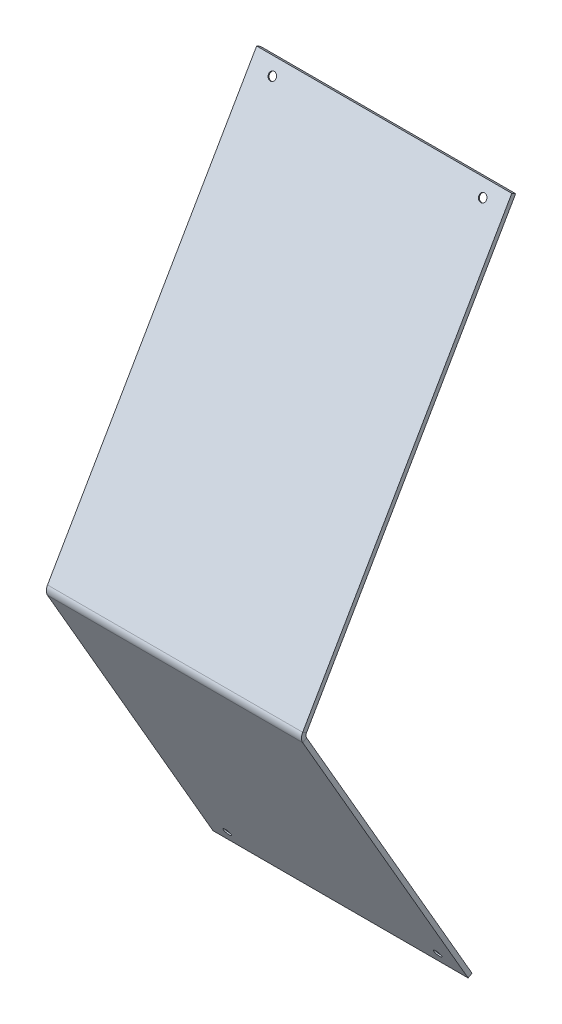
ISO-10303-21;
HEADER;
FILE_DESCRIPTION(('STEP AP214'),'2;1');
FILE_NAME('part.step','',(''),(''),'','','');
FILE_SCHEMA(('AUTOMOTIVE_DESIGN { 1 0 10303 214 1 1 1 1 }'));
ENDSEC;
DATA;
#1=APPLICATION_CONTEXT('core data for automotive mechanical design processes');
#2=APPLICATION_PROTOCOL_DEFINITION('international standard','automotive_design',2000,#1);
#3=PRODUCT_CONTEXT('',#1,'mechanical');
#4=PRODUCT('Part','Part','',(#3));
#5=PRODUCT_RELATED_PRODUCT_CATEGORY('part','',(#4));
#6=PRODUCT_DEFINITION_FORMATION('','',#4);
#7=PRODUCT_DEFINITION_CONTEXT('part definition',#1,'design');
#8=PRODUCT_DEFINITION('design','',#6,#7);
#9=PRODUCT_DEFINITION_SHAPE('','',#8);
#10=(LENGTH_UNIT() NAMED_UNIT(*) SI_UNIT(.MILLI.,.METRE.));
#11=(NAMED_UNIT(*) PLANE_ANGLE_UNIT() SI_UNIT($,.RADIAN.));
#12=(NAMED_UNIT(*) SI_UNIT($,.STERADIAN.) SOLID_ANGLE_UNIT());
#13=UNCERTAINTY_MEASURE_WITH_UNIT(LENGTH_MEASURE(1.E-05),#10,'distance_accuracy_value','');
#14=(GEOMETRIC_REPRESENTATION_CONTEXT(3) GLOBAL_UNCERTAINTY_ASSIGNED_CONTEXT((#13)) GLOBAL_UNIT_ASSIGNED_CONTEXT((#10,
#11,#12)) REPRESENTATION_CONTEXT('',''));
#15=CARTESIAN_POINT('',(0.,0.,0.));
#16=DIRECTION('',(0.,0.,1.));
#17=DIRECTION('',(1.,0.,0.));
#18=AXIS2_PLACEMENT_3D('',#15,#16,#17);
#19=CARTESIAN_POINT('',(57.,-1.00000000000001,-0.577350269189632));
#20=DIRECTION('',(1.,0.,0.));
#21=DIRECTION('',(0.,0.,-1.));
#22=AXIS2_PLACEMENT_3D('',#19,#20,#21);
#23=PLANE('',#22);
#24=DIRECTION('',(0.,-0.500000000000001,0.866025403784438));
#25=VECTOR('',#24,1.);
#26=CARTESIAN_POINT('',(57.,-1.00000000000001,-0.577350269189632));
#27=LINE('',#26,#25);
#28=CARTESIAN_POINT('',(57.,-1.00000000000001,-0.577350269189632));
#29=VERTEX_POINT('',#28);
#30=CARTESIAN_POINT('',(57.,-2.00000000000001,1.15470053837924));
#31=VERTEX_POINT('',#30);
#32=EDGE_CURVE('E11',#29,#31,#27,.T.);
#33=ORIENTED_EDGE('',*,*,#32,.F.);
#34=CARTESIAN_POINT('',(57.,0.,-2.3094010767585));
#35=DIRECTION('',(-1.,0.,0.));
#36=DIRECTION('',(0.,0.,1.));
#37=AXIS2_PLACEMENT_3D('',#34,#35,#36);
#38=CIRCLE('',#37,2.);
#39=CARTESIAN_POINT('',(57.,1.,-0.577350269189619));
#40=VERTEX_POINT('',#39);
#41=EDGE_CURVE('E133',#40,#29,#38,.F.);
#42=ORIENTED_EDGE('',*,*,#41,.F.);
#43=DIRECTION('',(0.,-0.500000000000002,-0.866025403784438));
#44=VECTOR('',#43,1.);
#45=CARTESIAN_POINT('',(57.,2.,1.15470053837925));
#46=LINE('',#45,#44);
#47=CARTESIAN_POINT('',(57.,2.,1.15470053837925));
#48=VERTEX_POINT('',#47);
#49=EDGE_CURVE('E43',#48,#40,#46,.T.);
#50=ORIENTED_EDGE('',*,*,#49,.F.);
#51=CARTESIAN_POINT('',(57.,0.,-2.3094010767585));
#52=DIRECTION('',(1.,0.,0.));
#53=DIRECTION('',(0.,0.,-1.));
#54=AXIS2_PLACEMENT_3D('',#51,#52,#53);
#55=CIRCLE('',#54,4.);
#56=EDGE_CURVE('E126',#48,#31,#55,.T.);
#57=ORIENTED_EDGE('',*,*,#56,.T.);
#58=EDGE_LOOP('',(#33,#42,#50,#57));
#59=FACE_BOUND('',#58,.T.);
#60=ADVANCED_FACE('F34',(#59),#23,.T.);
#61=CARTESIAN_POINT('',(57.,2.,1.15470053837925));
#62=DIRECTION('',(1.,0.,0.));
#63=DIRECTION('',(0.,0.,-1.));
#64=AXIS2_PLACEMENT_3D('',#61,#62,#63);
#65=PLANE('',#64);
#66=DIRECTION('',(0.,-0.866025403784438,-0.500000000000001));
#67=VECTOR('',#66,1.);
#68=CARTESIAN_POINT('',(57.,0.,0.));
#69=LINE('',#68,#67);
#70=CARTESIAN_POINT('',(57.,-129.037785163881,-74.5000000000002));
#71=VERTEX_POINT('',#70);
#72=EDGE_CURVE('E209',#29,#71,#69,.T.);
#73=ORIENTED_EDGE('',*,*,#72,.F.);
#74=ORIENTED_EDGE('',*,*,#32,.T.);
#75=DIRECTION('',(0.,-0.866025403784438,-0.500000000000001));
#76=VECTOR('',#75,1.);
#77=CARTESIAN_POINT('',(57.,-1.,1.73205080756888));
#78=LINE('',#77,#76);
#79=CARTESIAN_POINT('',(57.,-130.037785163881,-72.7679491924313));
#80=VERTEX_POINT('',#79);
#81=EDGE_CURVE('E92',#31,#80,#78,.T.);
#82=ORIENTED_EDGE('',*,*,#81,.T.);
#83=DIRECTION('',(0.,-0.499999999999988,0.866025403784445));
#84=VECTOR('',#83,1.);
#85=CARTESIAN_POINT('',(57.,-129.037785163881,-74.5000000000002));
#86=LINE('',#85,#84);
#87=EDGE_CURVE('E206',#71,#80,#86,.T.);
#88=ORIENTED_EDGE('',*,*,#87,.F.);
#89=EDGE_LOOP('',(#73,#74,#82,#88));
#90=FACE_BOUND('',#89,.T.);
#91=ADVANCED_FACE('F229',(#90),#65,.T.);
#92=CARTESIAN_POINT('',(-57.,1.,-0.577350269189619));
#93=DIRECTION('',(-1.,0.,0.));
#94=DIRECTION('',(0.,0.,1.));
#95=AXIS2_PLACEMENT_3D('',#92,#93,#94);
#96=PLANE('',#95);
#97=DIRECTION('',(0.,0.500000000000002,0.866025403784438));
#98=VECTOR('',#97,1.);
#99=CARTESIAN_POINT('',(-57.,1.,-0.577350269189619));
#100=LINE('',#99,#98);
#101=CARTESIAN_POINT('',(-57.,1.,-0.577350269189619));
#102=VERTEX_POINT('',#101);
#103=CARTESIAN_POINT('',(-57.,2.,1.15470053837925));
#104=VERTEX_POINT('',#103);
#105=EDGE_CURVE('E79',#102,#104,#100,.T.);
#106=ORIENTED_EDGE('',*,*,#105,.F.);
#107=CARTESIAN_POINT('',(-57.,0.,-2.3094010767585));
#108=DIRECTION('',(-1.,0.,0.));
#109=DIRECTION('',(0.,0.,1.));
#110=AXIS2_PLACEMENT_3D('',#107,#108,#109);
#111=CIRCLE('',#110,2.);
#112=CARTESIAN_POINT('',(-57.,-1.00000000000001,-0.577350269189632));
#113=VERTEX_POINT('',#112);
#114=EDGE_CURVE('E149',#102,#113,#111,.F.);
#115=ORIENTED_EDGE('',*,*,#114,.T.);
#116=DIRECTION('',(0.,0.500000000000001,-0.866025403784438));
#117=VECTOR('',#116,1.);
#118=CARTESIAN_POINT('',(-57.,-2.00000000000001,1.15470053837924));
#119=LINE('',#118,#117);
#120=CARTESIAN_POINT('',(-57.,-2.00000000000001,1.15470053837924));
#121=VERTEX_POINT('',#120);
#122=EDGE_CURVE('E86',#121,#113,#119,.T.);
#123=ORIENTED_EDGE('',*,*,#122,.F.);
#124=CARTESIAN_POINT('',(-57.,0.,-2.3094010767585));
#125=DIRECTION('',(1.,0.,0.));
#126=DIRECTION('',(0.,0.,-1.));
#127=AXIS2_PLACEMENT_3D('',#124,#125,#126);
#128=CIRCLE('',#127,4.);
#129=EDGE_CURVE('E156',#104,#121,#128,.T.);
#130=ORIENTED_EDGE('',*,*,#129,.F.);
#131=EDGE_LOOP('',(#106,#115,#123,#130));
#132=FACE_BOUND('',#131,.T.);
#133=ADVANCED_FACE('F227',(#132),#96,.T.);
#134=CARTESIAN_POINT('',(-57.,-2.00000000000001,1.15470053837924));
#135=DIRECTION('',(-1.,0.,0.));
#136=DIRECTION('',(0.,0.,1.));
#137=AXIS2_PLACEMENT_3D('',#134,#135,#136);
#138=PLANE('',#137);
#139=DIRECTION('',(0.,-0.866025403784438,0.500000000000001));
#140=VECTOR('',#139,1.);
#141=CARTESIAN_POINT('',(-57.,162.812775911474,-94.0000000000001));
#142=LINE('',#141,#140);
#143=CARTESIAN_POINT('',(-57.,162.812775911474,-94.0000000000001));
#144=VERTEX_POINT('',#143);
#145=EDGE_CURVE('E151',#144,#102,#142,.T.);
#146=ORIENTED_EDGE('',*,*,#145,.T.);
#147=ORIENTED_EDGE('',*,*,#105,.T.);
#148=DIRECTION('',(0.,-0.866025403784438,0.500000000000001));
#149=VECTOR('',#148,1.);
#150=CARTESIAN_POINT('',(-57.,163.812775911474,-92.2679491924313));
#151=LINE('',#150,#149);
#152=CARTESIAN_POINT('',(-57.,163.812775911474,-92.2679491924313));
#153=VERTEX_POINT('',#152);
#154=EDGE_CURVE('E154',#153,#104,#151,.T.);
#155=ORIENTED_EDGE('',*,*,#154,.F.);
#156=DIRECTION('',(0.,-0.500000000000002,-0.866025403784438));
#157=VECTOR('',#156,1.);
#158=CARTESIAN_POINT('',(-57.,163.812775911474,-92.2679491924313));
#159=LINE('',#158,#157);
#160=EDGE_CURVE('E114',#153,#144,#159,.T.);
#161=ORIENTED_EDGE('',*,*,#160,.T.);
#162=EDGE_LOOP('',(#146,#147,#155,#161));
#163=FACE_BOUND('',#162,.T.);
#164=ADVANCED_FACE('F223',(#163),#138,.T.);
#165=CARTESIAN_POINT('',(57.,-1.,1.73205080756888));
#166=DIRECTION('',(0.,0.500000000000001,-0.866025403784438));
#167=DIRECTION('',(0.,0.866025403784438,0.500000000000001));
#168=AXIS2_PLACEMENT_3D('',#165,#166,#167);
#169=PLANE('',#168);
#170=CARTESIAN_POINT('',(47.,-123.740553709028,-69.1322409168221));
#171=DIRECTION('',(0.,0.500000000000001,-0.866025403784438));
#172=DIRECTION('',(0.,0.866025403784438,0.500000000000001));
#173=AXIS2_PLACEMENT_3D('',#170,#171,#172);
#174=CIRCLE('',#173,1.69999999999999);
#175=CARTESIAN_POINT('',(47.,-122.268310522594,-68.2822409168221));
#176=VERTEX_POINT('',#175);
#177=EDGE_CURVE('E37',#176,#176,#174,.T.);
#178=ORIENTED_EDGE('',*,*,#177,.T.);
#179=EDGE_LOOP('',(#178));
#180=FACE_BOUND('',#179,.T.);
#181=CARTESIAN_POINT('',(-47.,-123.740553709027,-69.1322409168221));
#182=DIRECTION('',(0.,0.500000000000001,-0.866025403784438));
#183=DIRECTION('',(0.,0.866025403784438,0.500000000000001));
#184=AXIS2_PLACEMENT_3D('',#181,#182,#183);
#185=CIRCLE('',#184,1.69999999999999);
#186=CARTESIAN_POINT('',(-47.,-122.268310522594,-68.2822409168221));
#187=VERTEX_POINT('',#186);
#188=EDGE_CURVE('E182',#187,#187,#185,.T.);
#189=ORIENTED_EDGE('',*,*,#188,.T.);
#190=EDGE_LOOP('',(#189));
#191=FACE_BOUND('',#190,.T.);
#192=DIRECTION('',(0.,-0.866025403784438,-0.500000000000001));
#193=VECTOR('',#192,1.);
#194=CARTESIAN_POINT('',(-57.,-1.,1.73205080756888));
#195=LINE('',#194,#193);
#196=CARTESIAN_POINT('',(-57.,-130.037785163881,-72.7679491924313));
#197=VERTEX_POINT('',#196);
#198=EDGE_CURVE('E139',#121,#197,#195,.T.);
#199=ORIENTED_EDGE('',*,*,#198,.T.);
#200=DIRECTION('',(-1.,0.,0.));
#201=VECTOR('',#200,1.);
#202=CARTESIAN_POINT('',(57.,-130.037785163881,-72.7679491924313));
#203=LINE('',#202,#201);
#204=EDGE_CURVE('E170',#80,#197,#203,.T.);
#205=ORIENTED_EDGE('',*,*,#204,.F.);
#206=ORIENTED_EDGE('',*,*,#81,.F.);
#207=DIRECTION('',(-1.,0.,0.));
#208=VECTOR('',#207,1.);
#209=CARTESIAN_POINT('',(57.,-2.00000000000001,1.15470053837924));
#210=LINE('',#209,#208);
#211=EDGE_CURVE('E138',#31,#121,#210,.T.);
#212=ORIENTED_EDGE('',*,*,#211,.T.);
#213=EDGE_LOOP('',(#199,#205,#206,#212));
#214=FACE_BOUND('',#213,.T.);
#215=ADVANCED_FACE('F235',(#180,#191,#214),#169,.F.);
#216=CARTESIAN_POINT('',(57.,-129.037785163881,-74.5000000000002));
#217=DIRECTION('',(0.,-0.866025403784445,-0.499999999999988));
#218=DIRECTION('',(0.,0.499999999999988,-0.866025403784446));
#219=AXIS2_PLACEMENT_3D('',#216,#217,#218);
#220=PLANE('',#219);
#221=DIRECTION('',(0.,-0.499999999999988,0.866025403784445));
#222=VECTOR('',#221,1.);
#223=CARTESIAN_POINT('',(-57.,-129.037785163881,-74.5000000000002));
#224=LINE('',#223,#222);
#225=CARTESIAN_POINT('',(-57.,-129.037785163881,-74.5000000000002));
#226=VERTEX_POINT('',#225);
#227=EDGE_CURVE('E142',#226,#197,#224,.T.);
#228=ORIENTED_EDGE('',*,*,#227,.F.);
#229=DIRECTION('',(-1.,0.,0.));
#230=VECTOR('',#229,1.);
#231=CARTESIAN_POINT('',(57.,-129.037785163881,-74.5000000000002));
#232=LINE('',#231,#230);
#233=EDGE_CURVE('E168',#71,#226,#232,.T.);
#234=ORIENTED_EDGE('',*,*,#233,.F.);
#235=ORIENTED_EDGE('',*,*,#87,.T.);
#236=ORIENTED_EDGE('',*,*,#204,.T.);
#237=EDGE_LOOP('',(#228,#234,#235,#236));
#238=FACE_BOUND('',#237,.T.);
#239=ADVANCED_FACE('F264',(#238),#220,.T.);
#240=CARTESIAN_POINT('',(57.,0.,0.));
#241=DIRECTION('',(0.,0.500000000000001,-0.866025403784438));
#242=DIRECTION('',(0.,0.866025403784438,0.500000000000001));
#243=AXIS2_PLACEMENT_3D('',#240,#241,#242);
#244=PLANE('',#243);
#245=CARTESIAN_POINT('',(47.,-122.740553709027,-70.864291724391));
#246=DIRECTION('',(0.,0.500000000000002,-0.866025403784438));
#247=DIRECTION('',(0.,0.866025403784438,0.500000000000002));
#248=AXIS2_PLACEMENT_3D('',#245,#246,#247);
#249=CIRCLE('',#248,3.15);
#250=CARTESIAN_POINT('',(47.,-120.012573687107,-69.289291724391));
#251=VERTEX_POINT('',#250);
#252=EDGE_CURVE('E445',#251,#251,#249,.T.);
#253=ORIENTED_EDGE('',*,*,#252,.F.);
#254=EDGE_LOOP('',(#253));
#255=FACE_BOUND('',#254,.T.);
#256=CARTESIAN_POINT('',(-47.,-122.740553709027,-70.864291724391));
#257=DIRECTION('',(0.,0.500000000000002,-0.866025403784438));
#258=DIRECTION('',(0.,0.866025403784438,0.500000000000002));
#259=AXIS2_PLACEMENT_3D('',#256,#257,#258);
#260=CIRCLE('',#259,3.15);
#261=CARTESIAN_POINT('',(-47.,-120.012573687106,-69.289291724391));
#262=VERTEX_POINT('',#261);
#263=EDGE_CURVE('E191',#262,#262,#260,.T.);
#264=ORIENTED_EDGE('',*,*,#263,.F.);
#265=EDGE_LOOP('',(#264));
#266=FACE_BOUND('',#265,.T.);
#267=DIRECTION('',(0.,-0.866025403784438,-0.500000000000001));
#268=VECTOR('',#267,1.);
#269=CARTESIAN_POINT('',(-57.,0.,0.));
#270=LINE('',#269,#268);
#271=EDGE_CURVE('E146',#113,#226,#270,.T.);
#272=ORIENTED_EDGE('',*,*,#271,.F.);
#273=DIRECTION('',(-1.,0.,0.));
#274=VECTOR('',#273,1.);
#275=CARTESIAN_POINT('',(57.,-1.00000000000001,-0.577350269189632));
#276=LINE('',#275,#274);
#277=EDGE_CURVE('E165',#29,#113,#276,.T.);
#278=ORIENTED_EDGE('',*,*,#277,.F.);
#279=ORIENTED_EDGE('',*,*,#72,.T.);
#280=ORIENTED_EDGE('',*,*,#233,.T.);
#281=EDGE_LOOP('',(#272,#278,#279,#280));
#282=FACE_BOUND('',#281,.T.);
#283=ADVANCED_FACE('F269',(#255,#266,#282),#244,.T.);
#284=CARTESIAN_POINT('',(57.,0.,-2.3094010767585));
#285=DIRECTION('',(-1.,0.,0.));
#286=DIRECTION('',(0.,0.,1.));
#287=AXIS2_PLACEMENT_3D('',#284,#285,#286);
#288=CYLINDRICAL_SURFACE('',#287,2.);
#289=ORIENTED_EDGE('',*,*,#114,.F.);
#290=DIRECTION('',(-1.,0.,0.));
#291=VECTOR('',#290,1.);
#292=CARTESIAN_POINT('',(57.,1.,-0.577350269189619));
#293=LINE('',#292,#291);
#294=EDGE_CURVE('E162',#40,#102,#293,.T.);
#295=ORIENTED_EDGE('',*,*,#294,.F.);
#296=ORIENTED_EDGE('',*,*,#41,.T.);
#297=ORIENTED_EDGE('',*,*,#277,.T.);
#298=EDGE_LOOP('',(#289,#295,#296,#297));
#299=FACE_BOUND('',#298,.T.);
#300=ADVANCED_FACE('F216',(#299),#288,.F.);
#301=CARTESIAN_POINT('',(57.,162.812775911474,-94.0000000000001));
#302=DIRECTION('',(0.,-0.500000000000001,-0.866025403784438));
#303=DIRECTION('',(0.,0.866025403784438,-0.500000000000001));
#304=AXIS2_PLACEMENT_3D('',#301,#302,#303);
#305=PLANE('',#304);
#306=CARTESIAN_POINT('',(47.,157.616623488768,-91.0000000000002));
#307=DIRECTION('',(0.,-0.500000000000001,-0.866025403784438));
#308=DIRECTION('',(0.,0.866025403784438,-0.500000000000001));
#309=AXIS2_PLACEMENT_3D('',#306,#307,#308);
#310=CIRCLE('',#309,3.15);
#311=CARTESIAN_POINT('',(47.,160.344603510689,-92.5750000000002));
#312=VERTEX_POINT('',#311);
#313=EDGE_CURVE('E184',#312,#312,#310,.T.);
#314=ORIENTED_EDGE('',*,*,#313,.F.);
#315=EDGE_LOOP('',(#314));
#316=FACE_BOUND('',#315,.T.);
#317=CARTESIAN_POINT('',(-47.,157.616623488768,-91.0000000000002));
#318=DIRECTION('',(0.,-0.500000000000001,-0.866025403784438));
#319=DIRECTION('',(0.,0.866025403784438,-0.500000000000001));
#320=AXIS2_PLACEMENT_3D('',#317,#318,#319);
#321=CIRCLE('',#320,3.15);
#322=CARTESIAN_POINT('',(-47.,160.344603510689,-92.5750000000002));
#323=VERTEX_POINT('',#322);
#324=EDGE_CURVE('E180',#323,#323,#321,.T.);
#325=ORIENTED_EDGE('',*,*,#324,.F.);
#326=EDGE_LOOP('',(#325));
#327=FACE_BOUND('',#326,.T.);
#328=ORIENTED_EDGE('',*,*,#145,.F.);
#329=DIRECTION('',(-1.,0.,0.));
#330=VECTOR('',#329,1.);
#331=CARTESIAN_POINT('',(57.,162.812775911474,-94.0000000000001));
#332=LINE('',#331,#330);
#333=CARTESIAN_POINT('',(57.,162.812775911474,-94.0000000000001));
#334=VERTEX_POINT('',#333);
#335=EDGE_CURVE('E116',#334,#144,#332,.T.);
#336=ORIENTED_EDGE('',*,*,#335,.F.);
#337=DIRECTION('',(0.,-0.866025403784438,0.500000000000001));
#338=VECTOR('',#337,1.);
#339=CARTESIAN_POINT('',(57.,162.812775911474,-94.0000000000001));
#340=LINE('',#339,#338);
#341=EDGE_CURVE('E131',#334,#40,#340,.T.);
#342=ORIENTED_EDGE('',*,*,#341,.T.);
#343=ORIENTED_EDGE('',*,*,#294,.T.);
#344=EDGE_LOOP('',(#328,#336,#342,#343));
#345=FACE_BOUND('',#344,.T.);
#346=ADVANCED_FACE('F222',(#316,#327,#345),#305,.T.);
#347=CARTESIAN_POINT('',(57.,163.812775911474,-92.2679491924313));
#348=DIRECTION('',(0.,0.866025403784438,-0.500000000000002));
#349=DIRECTION('',(0.,0.500000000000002,0.866025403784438));
#350=AXIS2_PLACEMENT_3D('',#347,#348,#349);
#351=PLANE('',#350);
#352=ORIENTED_EDGE('',*,*,#160,.F.);
#353=DIRECTION('',(-1.,0.,0.));
#354=VECTOR('',#353,1.);
#355=CARTESIAN_POINT('',(57.,163.812775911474,-92.2679491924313));
#356=LINE('',#355,#354);
#357=CARTESIAN_POINT('',(57.,163.812775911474,-92.2679491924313));
#358=VERTEX_POINT('',#357);
#359=EDGE_CURVE('E108',#358,#153,#356,.T.);
#360=ORIENTED_EDGE('',*,*,#359,.F.);
#361=DIRECTION('',(0.,-0.500000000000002,-0.866025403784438));
#362=VECTOR('',#361,1.);
#363=CARTESIAN_POINT('',(57.,163.812775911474,-92.2679491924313));
#364=LINE('',#363,#362);
#365=EDGE_CURVE('E112',#358,#334,#364,.T.);
#366=ORIENTED_EDGE('',*,*,#365,.T.);
#367=ORIENTED_EDGE('',*,*,#335,.T.);
#368=EDGE_LOOP('',(#352,#360,#366,#367));
#369=FACE_BOUND('',#368,.T.);
#370=ADVANCED_FACE('F110',(#369),#351,.T.);
#371=CARTESIAN_POINT('',(57.,163.812775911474,-92.2679491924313));
#372=DIRECTION('',(0.,-0.500000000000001,-0.866025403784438));
#373=DIRECTION('',(0.,0.866025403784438,-0.500000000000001));
#374=AXIS2_PLACEMENT_3D('',#371,#372,#373);
#375=PLANE('',#374);
#376=CARTESIAN_POINT('',(47.,158.616623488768,-89.2679491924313));
#377=DIRECTION('',(0.,-0.500000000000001,-0.866025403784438));
#378=DIRECTION('',(0.,0.866025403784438,-0.500000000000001));
#379=AXIS2_PLACEMENT_3D('',#376,#377,#378);
#380=CIRCLE('',#379,1.69999999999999);
#381=CARTESIAN_POINT('',(47.,160.088866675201,-90.1179491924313));
#382=VERTEX_POINT('',#381);
#383=EDGE_CURVE('E178',#382,#382,#380,.T.);
#384=ORIENTED_EDGE('',*,*,#383,.T.);
#385=EDGE_LOOP('',(#384));
#386=FACE_BOUND('',#385,.T.);
#387=CARTESIAN_POINT('',(-47.,158.616623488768,-89.2679491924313));
#388=DIRECTION('',(0.,-0.500000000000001,-0.866025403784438));
#389=DIRECTION('',(0.,0.866025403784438,-0.500000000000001));
#390=AXIS2_PLACEMENT_3D('',#387,#388,#389);
#391=CIRCLE('',#390,1.69999999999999);
#392=CARTESIAN_POINT('',(-47.,160.088866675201,-90.1179491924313));
#393=VERTEX_POINT('',#392);
#394=EDGE_CURVE('E143',#393,#393,#391,.T.);
#395=ORIENTED_EDGE('',*,*,#394,.T.);
#396=EDGE_LOOP('',(#395));
#397=FACE_BOUND('',#396,.T.);
#398=ORIENTED_EDGE('',*,*,#154,.T.);
#399=DIRECTION('',(-1.,0.,0.));
#400=VECTOR('',#399,1.);
#401=CARTESIAN_POINT('',(57.,2.,1.15470053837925));
#402=LINE('',#401,#400);
#403=EDGE_CURVE('E117',#48,#104,#402,.T.);
#404=ORIENTED_EDGE('',*,*,#403,.F.);
#405=DIRECTION('',(0.,-0.866025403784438,0.500000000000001));
#406=VECTOR('',#405,1.);
#407=CARTESIAN_POINT('',(57.,163.812775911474,-92.2679491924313));
#408=LINE('',#407,#406);
#409=EDGE_CURVE('E121',#358,#48,#408,.T.);
#410=ORIENTED_EDGE('',*,*,#409,.F.);
#411=ORIENTED_EDGE('',*,*,#359,.T.);
#412=EDGE_LOOP('',(#398,#404,#410,#411));
#413=FACE_BOUND('',#412,.T.);
#414=ADVANCED_FACE('F122',(#386,#397,#413),#375,.F.);
#415=CARTESIAN_POINT('',(57.,0.,-2.3094010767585));
#416=DIRECTION('',(-1.,0.,0.));
#417=DIRECTION('',(0.,0.,1.));
#418=AXIS2_PLACEMENT_3D('',#415,#416,#417);
#419=CYLINDRICAL_SURFACE('',#418,4.);
#420=ORIENTED_EDGE('',*,*,#129,.T.);
#421=ORIENTED_EDGE('',*,*,#211,.F.);
#422=ORIENTED_EDGE('',*,*,#56,.F.);
#423=ORIENTED_EDGE('',*,*,#403,.T.);
#424=EDGE_LOOP('',(#420,#421,#422,#423));
#425=FACE_BOUND('',#424,.T.);
#426=ADVANCED_FACE('F225',(#425),#419,.T.);
#427=CARTESIAN_POINT('',(57.,0.,-2.3094010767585));
#428=DIRECTION('',(-1.,0.,0.));
#429=DIRECTION('',(0.,0.,1.));
#430=AXIS2_PLACEMENT_3D('',#427,#428,#429);
#431=PLANE('',#430);
#432=ORIENTED_EDGE('',*,*,#409,.T.);
#433=ORIENTED_EDGE('',*,*,#49,.T.);
#434=ORIENTED_EDGE('',*,*,#341,.F.);
#435=ORIENTED_EDGE('',*,*,#365,.F.);
#436=EDGE_LOOP('',(#432,#433,#434,#435));
#437=FACE_BOUND('',#436,.T.);
#438=ADVANCED_FACE('F129',(#437),#431,.F.);
#439=CARTESIAN_POINT('',(-57.,0.,-2.3094010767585));
#440=DIRECTION('',(-1.,0.,0.));
#441=DIRECTION('',(0.,0.,1.));
#442=AXIS2_PLACEMENT_3D('',#439,#440,#441);
#443=PLANE('',#442);
#444=ORIENTED_EDGE('',*,*,#198,.F.);
#445=ORIENTED_EDGE('',*,*,#122,.T.);
#446=ORIENTED_EDGE('',*,*,#271,.T.);
#447=ORIENTED_EDGE('',*,*,#227,.T.);
#448=EDGE_LOOP('',(#444,#445,#446,#447));
#449=FACE_BOUND('',#448,.T.);
#450=ADVANCED_FACE('F313',(#449),#443,.T.);
#451=CARTESIAN_POINT('',(-47.,157.616623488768,-91.0000000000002));
#452=DIRECTION('',(0.,-0.500000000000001,-0.866025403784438));
#453=DIRECTION('',(0.,0.866025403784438,-0.500000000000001));
#454=AXIS2_PLACEMENT_3D('',#451,#452,#453);
#455=CYLINDRICAL_SURFACE('',#454,1.69999999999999);
#456=CARTESIAN_POINT('',(-47.,158.341623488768,-89.7442631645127));
#457=DIRECTION('',(0.,-0.500000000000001,-0.866025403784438));
#458=DIRECTION('',(0.,0.866025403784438,-0.500000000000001));
#459=AXIS2_PLACEMENT_3D('',#456,#457,#458);
#460=CIRCLE('',#459,1.7);
#461=CARTESIAN_POINT('',(-47.,159.813866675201,-90.5942631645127));
#462=VERTEX_POINT('',#461);
#463=EDGE_CURVE('E177',#462,#462,#460,.T.);
#464=ORIENTED_EDGE('',*,*,#463,.T.);
#465=EDGE_LOOP('',(#464));
#466=FACE_BOUND('',#465,.T.);
#467=ORIENTED_EDGE('',*,*,#394,.F.);
#468=EDGE_LOOP('',(#467));
#469=FACE_BOUND('',#468,.T.);
#470=ADVANCED_FACE('F323',(#466,#469),#455,.F.);
#471=CARTESIAN_POINT('',(-47.,157.616623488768,-91.0000000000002));
#472=DIRECTION('',(0.,-0.500000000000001,-0.866025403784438));
#473=DIRECTION('',(0.,0.866025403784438,-0.500000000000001));
#474=AXIS2_PLACEMENT_3D('',#471,#472,#473);
#475=CONICAL_SURFACE('',#474,3.15,0.785398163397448);
#476=ORIENTED_EDGE('',*,*,#463,.F.);
#477=EDGE_LOOP('',(#476));
#478=FACE_BOUND('',#477,.T.);
#479=ORIENTED_EDGE('',*,*,#324,.T.);
#480=EDGE_LOOP('',(#479));
#481=FACE_BOUND('',#480,.T.);
#482=ADVANCED_FACE('F350',(#478,#481),#475,.F.);
#483=CARTESIAN_POINT('',(47.,157.616623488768,-91.0000000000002));
#484=DIRECTION('',(0.,-0.500000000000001,-0.866025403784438));
#485=DIRECTION('',(0.,0.866025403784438,-0.500000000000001));
#486=AXIS2_PLACEMENT_3D('',#483,#484,#485);
#487=CYLINDRICAL_SURFACE('',#486,1.69999999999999);
#488=CARTESIAN_POINT('',(47.,158.341623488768,-89.7442631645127));
#489=DIRECTION('',(0.,-0.500000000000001,-0.866025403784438));
#490=DIRECTION('',(0.,0.866025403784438,-0.500000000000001));
#491=AXIS2_PLACEMENT_3D('',#488,#489,#490);
#492=CIRCLE('',#491,1.7);
#493=CARTESIAN_POINT('',(47.,159.813866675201,-90.5942631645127));
#494=VERTEX_POINT('',#493);
#495=EDGE_CURVE('E181',#494,#494,#492,.T.);
#496=ORIENTED_EDGE('',*,*,#495,.T.);
#497=EDGE_LOOP('',(#496));
#498=FACE_BOUND('',#497,.T.);
#499=ORIENTED_EDGE('',*,*,#383,.F.);
#500=EDGE_LOOP('',(#499));
#501=FACE_BOUND('',#500,.T.);
#502=ADVANCED_FACE('F360',(#498,#501),#487,.F.);
#503=CARTESIAN_POINT('',(47.,157.616623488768,-91.0000000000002));
#504=DIRECTION('',(0.,-0.500000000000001,-0.866025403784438));
#505=DIRECTION('',(0.,0.866025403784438,-0.500000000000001));
#506=AXIS2_PLACEMENT_3D('',#503,#504,#505);
#507=CONICAL_SURFACE('',#506,3.15,0.785398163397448);
#508=ORIENTED_EDGE('',*,*,#495,.F.);
#509=EDGE_LOOP('',(#508));
#510=FACE_BOUND('',#509,.T.);
#511=ORIENTED_EDGE('',*,*,#313,.T.);
#512=EDGE_LOOP('',(#511));
#513=FACE_BOUND('',#512,.T.);
#514=ADVANCED_FACE('F370',(#510,#513),#507,.F.);
#515=CARTESIAN_POINT('',(-47.,-122.740553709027,-70.864291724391));
#516=DIRECTION('',(0.,0.500000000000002,-0.866025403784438));
#517=DIRECTION('',(0.,0.866025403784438,0.500000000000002));
#518=AXIS2_PLACEMENT_3D('',#515,#516,#517);
#519=CYLINDRICAL_SURFACE('',#518,1.69999999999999);
#520=CARTESIAN_POINT('',(-47.,-123.465553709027,-69.6085548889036));
#521=DIRECTION('',(0.,0.500000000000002,-0.866025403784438));
#522=DIRECTION('',(0.,0.866025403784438,0.500000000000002));
#523=AXIS2_PLACEMENT_3D('',#520,#521,#522);
#524=CIRCLE('',#523,1.7);
#525=CARTESIAN_POINT('',(-47.,-121.993310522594,-68.7585548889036));
#526=VERTEX_POINT('',#525);
#527=EDGE_CURVE('E185',#526,#526,#524,.T.);
#528=ORIENTED_EDGE('',*,*,#527,.T.);
#529=EDGE_LOOP('',(#528));
#530=FACE_BOUND('',#529,.T.);
#531=ORIENTED_EDGE('',*,*,#188,.F.);
#532=EDGE_LOOP('',(#531));
#533=FACE_BOUND('',#532,.T.);
#534=ADVANCED_FACE('F380',(#530,#533),#519,.F.);
#535=CARTESIAN_POINT('',(-47.,-122.740553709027,-70.864291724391));
#536=DIRECTION('',(0.,0.500000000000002,-0.866025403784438));
#537=DIRECTION('',(0.,0.866025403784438,0.500000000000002));
#538=AXIS2_PLACEMENT_3D('',#535,#536,#537);
#539=CONICAL_SURFACE('',#538,3.15,0.785398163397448);
#540=ORIENTED_EDGE('',*,*,#527,.F.);
#541=EDGE_LOOP('',(#540));
#542=FACE_BOUND('',#541,.T.);
#543=ORIENTED_EDGE('',*,*,#263,.T.);
#544=EDGE_LOOP('',(#543));
#545=FACE_BOUND('',#544,.T.);
#546=ADVANCED_FACE('F406',(#542,#545),#539,.F.);
#547=CARTESIAN_POINT('',(47.,-122.740553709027,-70.864291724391));
#548=DIRECTION('',(0.,0.500000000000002,-0.866025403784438));
#549=DIRECTION('',(0.,0.866025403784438,0.500000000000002));
#550=AXIS2_PLACEMENT_3D('',#547,#548,#549);
#551=CYLINDRICAL_SURFACE('',#550,1.69999999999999);
#552=CARTESIAN_POINT('',(47.,-123.465553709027,-69.6085548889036));
#553=DIRECTION('',(0.,0.500000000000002,-0.866025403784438));
#554=DIRECTION('',(0.,0.866025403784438,0.500000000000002));
#555=AXIS2_PLACEMENT_3D('',#552,#553,#554);
#556=CIRCLE('',#555,1.7);
#557=CARTESIAN_POINT('',(47.,-121.993310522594,-68.7585548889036));
#558=VERTEX_POINT('',#557);
#559=EDGE_CURVE('E442',#558,#558,#556,.T.);
#560=ORIENTED_EDGE('',*,*,#559,.T.);
#561=EDGE_LOOP('',(#560));
#562=FACE_BOUND('',#561,.T.);
#563=ORIENTED_EDGE('',*,*,#177,.F.);
#564=EDGE_LOOP('',(#563));
#565=FACE_BOUND('',#564,.T.);
#566=ADVANCED_FACE('F415',(#562,#565),#551,.F.);
#567=CARTESIAN_POINT('',(47.,-122.740553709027,-70.864291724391));
#568=DIRECTION('',(0.,0.500000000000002,-0.866025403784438));
#569=DIRECTION('',(0.,0.866025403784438,0.500000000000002));
#570=AXIS2_PLACEMENT_3D('',#567,#568,#569);
#571=CONICAL_SURFACE('',#570,3.15,0.785398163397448);
#572=ORIENTED_EDGE('',*,*,#559,.F.);
#573=EDGE_LOOP('',(#572));
#574=FACE_BOUND('',#573,.T.);
#575=ORIENTED_EDGE('',*,*,#252,.T.);
#576=EDGE_LOOP('',(#575));
#577=FACE_BOUND('',#576,.T.);
#578=ADVANCED_FACE('F425',(#574,#577),#571,.F.);
#579=CLOSED_SHELL('',(#60,#91,#133,#164,#215,#239,#283,#300,#346,#370,#414,#426,#438,#450,#470,
#482,#502,#514,#534,#546,#566,#578));
#580=MANIFOLD_SOLID_BREP('B2',#579);
#581=ADVANCED_BREP_SHAPE_REPRESENTATION('',(#18,#580),#14);
#582=SHAPE_DEFINITION_REPRESENTATION(#9,#581);
ENDSEC;
END-ISO-10303-21;
